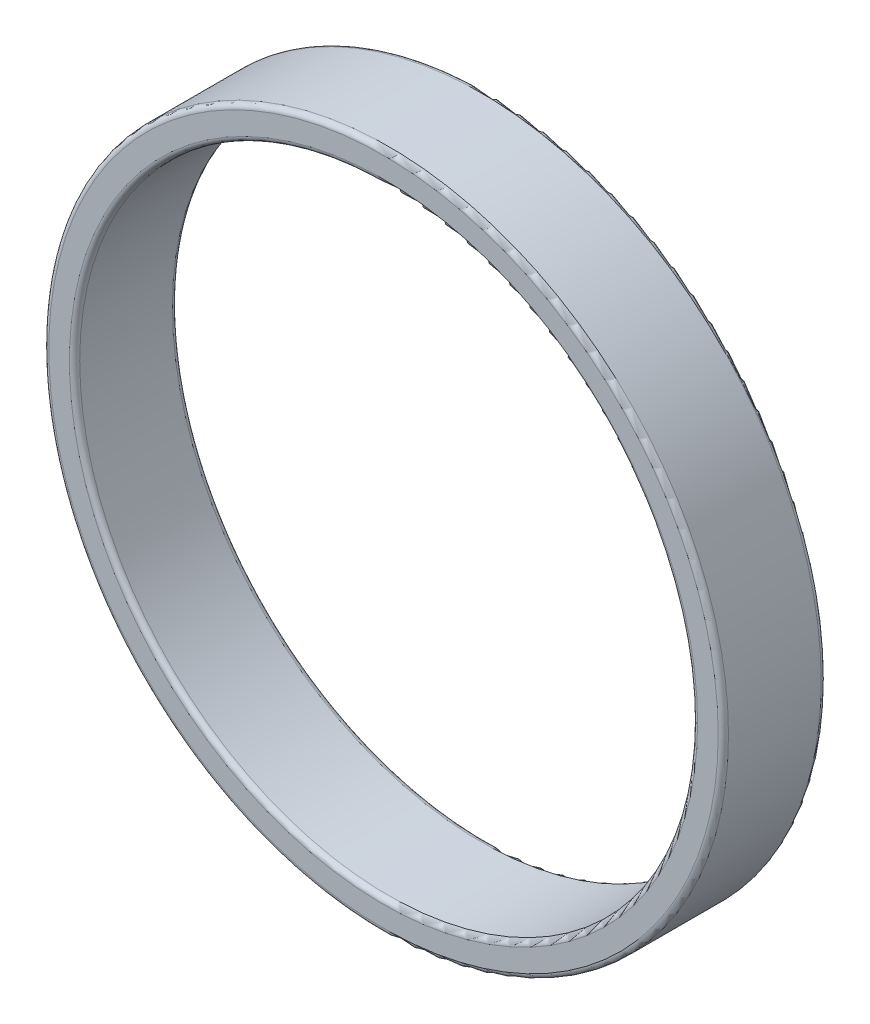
ISO-10303-21;
HEADER;
FILE_DESCRIPTION(('STEP AP214'),'2;1');
FILE_NAME('part.step','',(''),(''),'','','');
FILE_SCHEMA(('AUTOMOTIVE_DESIGN { 1 0 10303 214 1 1 1 1 }'));
ENDSEC;
DATA;
#1=APPLICATION_CONTEXT('core data for automotive mechanical design processes');
#2=APPLICATION_PROTOCOL_DEFINITION('international standard','automotive_design',2000,#1);
#3=PRODUCT_CONTEXT('',#1,'mechanical');
#4=PRODUCT('Part','Part','',(#3));
#5=PRODUCT_RELATED_PRODUCT_CATEGORY('part','',(#4));
#6=PRODUCT_DEFINITION_FORMATION('','',#4);
#7=PRODUCT_DEFINITION_CONTEXT('part definition',#1,'design');
#8=PRODUCT_DEFINITION('design','',#6,#7);
#9=PRODUCT_DEFINITION_SHAPE('','',#8);
#10=(LENGTH_UNIT() NAMED_UNIT(*) SI_UNIT(.MILLI.,.METRE.));
#11=(NAMED_UNIT(*) PLANE_ANGLE_UNIT() SI_UNIT($,.RADIAN.));
#12=(NAMED_UNIT(*) SI_UNIT($,.STERADIAN.) SOLID_ANGLE_UNIT());
#13=UNCERTAINTY_MEASURE_WITH_UNIT(LENGTH_MEASURE(1.E-05),#10,'distance_accuracy_value','');
#14=(GEOMETRIC_REPRESENTATION_CONTEXT(3) GLOBAL_UNCERTAINTY_ASSIGNED_CONTEXT((#13)) GLOBAL_UNIT_ASSIGNED_CONTEXT((#10,
#11,#12)) REPRESENTATION_CONTEXT('',''));
#15=CARTESIAN_POINT('',(0.,0.,0.));
#16=DIRECTION('',(0.,0.,1.));
#17=DIRECTION('',(1.,0.,0.));
#18=AXIS2_PLACEMENT_3D('',#15,#16,#17);
#19=CARTESIAN_POINT('',(0.,0.,6.35));
#20=DIRECTION('',(0.,0.,1.));
#21=DIRECTION('',(1.,0.,0.));
#22=AXIS2_PLACEMENT_3D('',#19,#20,#21);
#23=PLANE('',#22);
#24=CARTESIAN_POINT('',(0.,0.,6.35));
#25=DIRECTION('',(0.,0.,1.));
#26=DIRECTION('',(1.,0.,0.));
#27=AXIS2_PLACEMENT_3D('',#24,#25,#26);
#28=CIRCLE('',#27,38.735);
#29=CARTESIAN_POINT('',(38.735,0.,6.35));
#30=VERTEX_POINT('',#29);
#31=EDGE_CURVE('E42',#30,#30,#28,.F.);
#32=ORIENTED_EDGE('',*,*,#31,.T.);
#33=EDGE_LOOP('',(#32));
#34=FACE_BOUND('',#33,.T.);
#35=CARTESIAN_POINT('',(0.,0.,6.35));
#36=DIRECTION('',(0.,0.,1.));
#37=DIRECTION('',(1.,0.,0.));
#38=AXIS2_PLACEMENT_3D('',#35,#36,#37);
#39=CIRCLE('',#38,41.275);
#40=CARTESIAN_POINT('',(41.275,0.,6.35));
#41=VERTEX_POINT('',#40);
#42=EDGE_CURVE('E46',#41,#41,#39,.T.);
#43=ORIENTED_EDGE('',*,*,#42,.T.);
#44=EDGE_LOOP('',(#43));
#45=FACE_BOUND('',#44,.T.);
#46=ADVANCED_FACE('F31',(#34,#45),#23,.T.);
#47=CARTESIAN_POINT('',(0.,0.,-6.35));
#48=DIRECTION('',(0.,0.,1.));
#49=DIRECTION('',(1.,0.,0.));
#50=AXIS2_PLACEMENT_3D('',#47,#48,#49);
#51=PLANE('',#50);
#52=CARTESIAN_POINT('',(0.,0.,-6.35));
#53=DIRECTION('',(0.,0.,1.));
#54=DIRECTION('',(1.,0.,0.));
#55=AXIS2_PLACEMENT_3D('',#52,#53,#54);
#56=CIRCLE('',#55,38.735);
#57=CARTESIAN_POINT('',(38.735,0.,-6.35));
#58=VERTEX_POINT('',#57);
#59=EDGE_CURVE('E57',#58,#58,#56,.T.);
#60=ORIENTED_EDGE('',*,*,#59,.T.);
#61=EDGE_LOOP('',(#60));
#62=FACE_BOUND('',#61,.T.);
#63=CARTESIAN_POINT('',(0.,0.,-6.35));
#64=DIRECTION('',(0.,0.,1.));
#65=DIRECTION('',(1.,0.,0.));
#66=AXIS2_PLACEMENT_3D('',#63,#64,#65);
#67=CIRCLE('',#66,41.275);
#68=CARTESIAN_POINT('',(41.275,0.,-6.35));
#69=VERTEX_POINT('',#68);
#70=EDGE_CURVE('E60',#69,#69,#67,.F.);
#71=ORIENTED_EDGE('',*,*,#70,.T.);
#72=EDGE_LOOP('',(#71));
#73=FACE_BOUND('',#72,.T.);
#74=ADVANCED_FACE('F64',(#62,#73),#51,.F.);
#75=CARTESIAN_POINT('',(0.,0.,6.35));
#76=DIRECTION('',(0.,0.,-1.));
#77=DIRECTION('',(-1.,0.,0.));
#78=AXIS2_PLACEMENT_3D('',#75,#76,#77);
#79=CYLINDRICAL_SURFACE('',#78,41.91);
#80=CARTESIAN_POINT('',(0.,0.,-5.715));
#81=DIRECTION('',(0.,0.,1.));
#82=DIRECTION('',(1.,0.,0.));
#83=AXIS2_PLACEMENT_3D('',#80,#81,#82);
#84=CIRCLE('',#83,41.91);
#85=CARTESIAN_POINT('',(41.91,0.,-5.715));
#86=VERTEX_POINT('',#85);
#87=EDGE_CURVE('E10',#86,#86,#84,.T.);
#88=ORIENTED_EDGE('',*,*,#87,.T.);
#89=EDGE_LOOP('',(#88));
#90=FACE_BOUND('',#89,.T.);
#91=CARTESIAN_POINT('',(0.,0.,5.715));
#92=DIRECTION('',(0.,0.,1.));
#93=DIRECTION('',(1.,0.,0.));
#94=AXIS2_PLACEMENT_3D('',#91,#92,#93);
#95=CIRCLE('',#94,41.91);
#96=CARTESIAN_POINT('',(41.91,0.,5.715));
#97=VERTEX_POINT('',#96);
#98=EDGE_CURVE('E38',#97,#97,#95,.F.);
#99=ORIENTED_EDGE('',*,*,#98,.T.);
#100=EDGE_LOOP('',(#99));
#101=FACE_BOUND('',#100,.T.);
#102=ADVANCED_FACE('F84',(#90,#101),#79,.T.);
#103=CARTESIAN_POINT('',(0.,0.,6.35));
#104=DIRECTION('',(0.,0.,-1.));
#105=DIRECTION('',(-1.,0.,0.));
#106=AXIS2_PLACEMENT_3D('',#103,#104,#105);
#107=CYLINDRICAL_SURFACE('',#106,38.1);
#108=CARTESIAN_POINT('',(0.,0.,-5.715));
#109=DIRECTION('',(0.,0.,1.));
#110=DIRECTION('',(1.,0.,0.));
#111=AXIS2_PLACEMENT_3D('',#108,#109,#110);
#112=CIRCLE('',#111,38.1);
#113=CARTESIAN_POINT('',(38.1,0.,-5.715));
#114=VERTEX_POINT('',#113);
#115=EDGE_CURVE('E51',#114,#114,#112,.F.);
#116=ORIENTED_EDGE('',*,*,#115,.T.);
#117=EDGE_LOOP('',(#116));
#118=FACE_BOUND('',#117,.T.);
#119=CARTESIAN_POINT('',(0.,0.,5.715));
#120=DIRECTION('',(0.,0.,1.));
#121=DIRECTION('',(1.,0.,0.));
#122=AXIS2_PLACEMENT_3D('',#119,#120,#121);
#123=CIRCLE('',#122,38.1);
#124=CARTESIAN_POINT('',(38.1,0.,5.715));
#125=VERTEX_POINT('',#124);
#126=EDGE_CURVE('E54',#125,#125,#123,.T.);
#127=ORIENTED_EDGE('',*,*,#126,.T.);
#128=EDGE_LOOP('',(#127));
#129=FACE_BOUND('',#128,.T.);
#130=ADVANCED_FACE('F89',(#118,#129),#107,.F.);
#131=CARTESIAN_POINT('',(0.,0.,-5.715));
#132=DIRECTION('',(0.,0.,1.));
#133=DIRECTION('',(1.,0.,0.));
#134=AXIS2_PLACEMENT_3D('',#131,#132,#133);
#135=TOROIDAL_SURFACE('',#134,38.735,0.635);
#136=ORIENTED_EDGE('',*,*,#115,.F.);
#137=EDGE_LOOP('',(#136));
#138=FACE_BOUND('',#137,.T.);
#139=ORIENTED_EDGE('',*,*,#59,.F.);
#140=EDGE_LOOP('',(#139));
#141=FACE_BOUND('',#140,.T.);
#142=ADVANCED_FACE('F75',(#138,#141),#135,.T.);
#143=CARTESIAN_POINT('',(0.,0.,5.715));
#144=DIRECTION('',(0.,0.,1.));
#145=DIRECTION('',(1.,0.,0.));
#146=AXIS2_PLACEMENT_3D('',#143,#144,#145);
#147=TOROIDAL_SURFACE('',#146,38.735,0.635);
#148=ORIENTED_EDGE('',*,*,#31,.F.);
#149=EDGE_LOOP('',(#148));
#150=FACE_BOUND('',#149,.T.);
#151=ORIENTED_EDGE('',*,*,#126,.F.);
#152=EDGE_LOOP('',(#151));
#153=FACE_BOUND('',#152,.T.);
#154=ADVANCED_FACE('F69',(#150,#153),#147,.T.);
#155=CARTESIAN_POINT('',(0.,0.,-5.715));
#156=DIRECTION('',(0.,0.,1.));
#157=DIRECTION('',(1.,0.,0.));
#158=AXIS2_PLACEMENT_3D('',#155,#156,#157);
#159=TOROIDAL_SURFACE('',#158,41.275,0.635);
#160=ORIENTED_EDGE('',*,*,#70,.F.);
#161=EDGE_LOOP('',(#160));
#162=FACE_BOUND('',#161,.T.);
#163=ORIENTED_EDGE('',*,*,#87,.F.);
#164=EDGE_LOOP('',(#163));
#165=FACE_BOUND('',#164,.T.);
#166=ADVANCED_FACE('F66',(#162,#165),#159,.T.);
#167=CARTESIAN_POINT('',(0.,0.,5.715));
#168=DIRECTION('',(0.,0.,1.));
#169=DIRECTION('',(1.,0.,0.));
#170=AXIS2_PLACEMENT_3D('',#167,#168,#169);
#171=TOROIDAL_SURFACE('',#170,41.275,0.635);
#172=ORIENTED_EDGE('',*,*,#98,.F.);
#173=EDGE_LOOP('',(#172));
#174=FACE_BOUND('',#173,.T.);
#175=ORIENTED_EDGE('',*,*,#42,.F.);
#176=EDGE_LOOP('',(#175));
#177=FACE_BOUND('',#176,.T.);
#178=ADVANCED_FACE('F33',(#174,#177),#171,.T.);
#179=CLOSED_SHELL('',(#46,#74,#102,#130,#142,#154,#166,#178));
#180=MANIFOLD_SOLID_BREP('B2',#179);
#181=ADVANCED_BREP_SHAPE_REPRESENTATION('',(#18,#180),#14);
#182=SHAPE_DEFINITION_REPRESENTATION(#9,#181);
ENDSEC;
END-ISO-10303-21;
